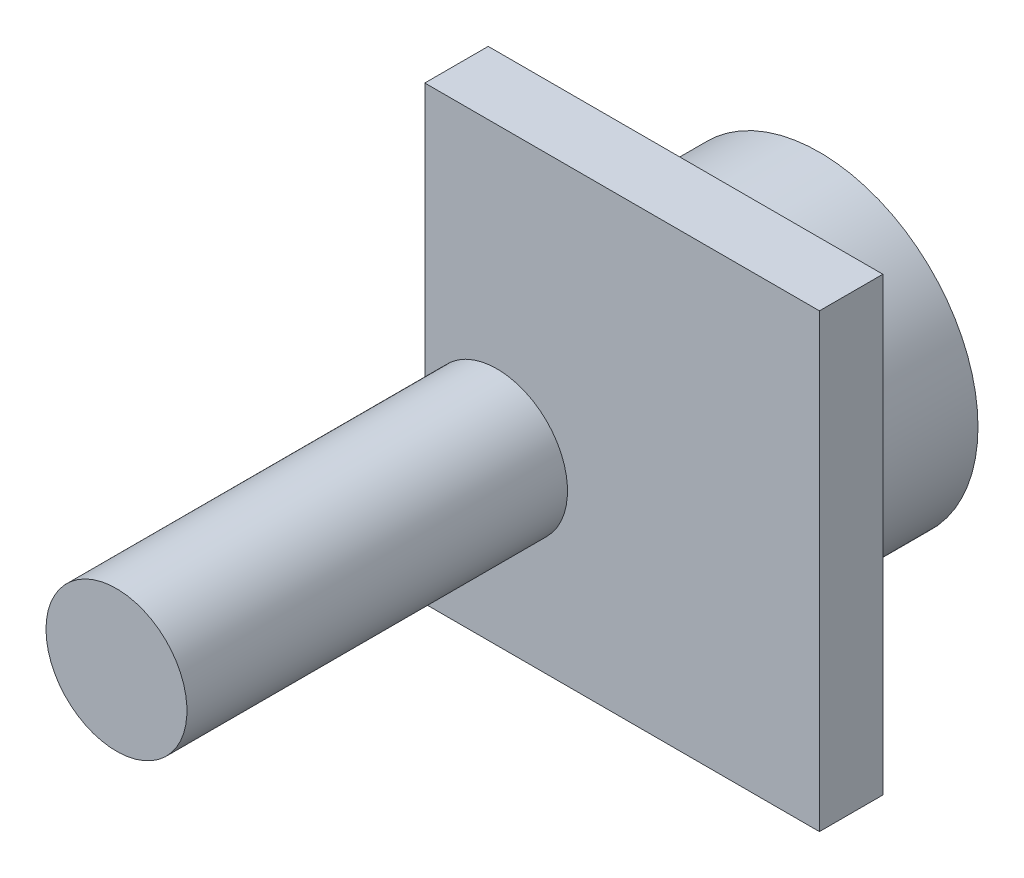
ISO-10303-21;
HEADER;
FILE_DESCRIPTION(('STEP AP214'),'2;1');
FILE_NAME('part.step','',(''),(''),'','','');
FILE_SCHEMA(('AUTOMOTIVE_DESIGN { 1 0 10303 214 1 1 1 1 }'));
ENDSEC;
DATA;
#1=APPLICATION_CONTEXT('core data for automotive mechanical design processes');
#2=APPLICATION_PROTOCOL_DEFINITION('international standard','automotive_design',2000,#1);
#3=PRODUCT_CONTEXT('',#1,'mechanical');
#4=PRODUCT('Part','Part','',(#3));
#5=PRODUCT_RELATED_PRODUCT_CATEGORY('part','',(#4));
#6=PRODUCT_DEFINITION_FORMATION('','',#4);
#7=PRODUCT_DEFINITION_CONTEXT('part definition',#1,'design');
#8=PRODUCT_DEFINITION('design','',#6,#7);
#9=PRODUCT_DEFINITION_SHAPE('','',#8);
#10=(LENGTH_UNIT() NAMED_UNIT(*) SI_UNIT(.MILLI.,.METRE.));
#11=(NAMED_UNIT(*) PLANE_ANGLE_UNIT() SI_UNIT($,.RADIAN.));
#12=(NAMED_UNIT(*) SI_UNIT($,.STERADIAN.) SOLID_ANGLE_UNIT());
#13=UNCERTAINTY_MEASURE_WITH_UNIT(LENGTH_MEASURE(1.E-05),#10,'distance_accuracy_value','');
#14=(GEOMETRIC_REPRESENTATION_CONTEXT(3) GLOBAL_UNCERTAINTY_ASSIGNED_CONTEXT((#13)) GLOBAL_UNIT_ASSIGNED_CONTEXT((#10,
#11,#12)) REPRESENTATION_CONTEXT('',''));
#15=CARTESIAN_POINT('',(0.,0.,0.));
#16=DIRECTION('',(0.,0.,1.));
#17=DIRECTION('',(1.,0.,0.));
#18=AXIS2_PLACEMENT_3D('',#15,#16,#17);
#19=CARTESIAN_POINT('',(0.,0.,0.));
#20=DIRECTION('',(0.,0.,1.));
#21=DIRECTION('',(1.,0.,0.));
#22=AXIS2_PLACEMENT_3D('',#19,#20,#21);
#23=CYLINDRICAL_SURFACE('',#22,3.);
#24=CARTESIAN_POINT('',(0.,0.,0.));
#25=DIRECTION('',(0.,0.,-1.));
#26=DIRECTION('',(-1.,0.,0.));
#27=AXIS2_PLACEMENT_3D('',#24,#25,#26);
#28=CIRCLE('',#27,3.);
#29=CARTESIAN_POINT('',(-3.,0.,0.));
#30=VERTEX_POINT('',#29);
#31=EDGE_CURVE('E11',#30,#30,#28,.T.);
#32=ORIENTED_EDGE('',*,*,#31,.F.);
#33=EDGE_LOOP('',(#32));
#34=FACE_BOUND('',#33,.T.);
#35=CARTESIAN_POINT('',(0.,0.,1.));
#36=DIRECTION('',(0.,0.,-1.));
#37=DIRECTION('',(-1.,0.,0.));
#38=AXIS2_PLACEMENT_3D('',#35,#36,#37);
#39=CIRCLE('',#38,3.);
#40=CARTESIAN_POINT('',(-3.,0.,1.));
#41=VERTEX_POINT('',#40);
#42=EDGE_CURVE('E53',#41,#41,#39,.T.);
#43=ORIENTED_EDGE('',*,*,#42,.T.);
#44=EDGE_LOOP('',(#43));
#45=FACE_BOUND('',#44,.T.);
#46=ADVANCED_FACE('F50',(#34,#45),#23,.T.);
#47=CARTESIAN_POINT('',(0.,0.,0.));
#48=DIRECTION('',(0.,0.,-1.));
#49=DIRECTION('',(-1.,0.,0.));
#50=AXIS2_PLACEMENT_3D('',#47,#48,#49);
#51=PLANE('',#50);
#52=ORIENTED_EDGE('',*,*,#31,.T.);
#53=EDGE_LOOP('',(#52));
#54=FACE_BOUND('',#53,.T.);
#55=ADVANCED_FACE('F65',(#54),#51,.T.);
#56=CARTESIAN_POINT('',(0.,0.,1.));
#57=DIRECTION('',(0.,0.,-1.));
#58=DIRECTION('',(-1.,0.,0.));
#59=AXIS2_PLACEMENT_3D('',#56,#57,#58);
#60=PLANE('',#59);
#61=ORIENTED_EDGE('',*,*,#42,.F.);
#62=EDGE_LOOP('',(#61));
#63=FACE_BOUND('',#62,.T.);
#64=ADVANCED_FACE('F63',(#63),#60,.F.);
#65=CLOSED_SHELL('',(#46,#55,#64));
#66=MANIFOLD_SOLID_BREP('B2',#65);
#67=CARTESIAN_POINT('',(0.,0.,4.));
#68=DIRECTION('',(0.,0.,-1.));
#69=DIRECTION('',(-1.,0.,0.));
#70=AXIS2_PLACEMENT_3D('',#67,#68,#69);
#71=CYLINDRICAL_SURFACE('',#70,4.5);
#72=CARTESIAN_POINT('',(0.,0.,4.));
#73=DIRECTION('',(0.,0.,1.));
#74=DIRECTION('',(1.,0.,0.));
#75=AXIS2_PLACEMENT_3D('',#72,#73,#74);
#76=CIRCLE('',#75,4.5);
#77=CARTESIAN_POINT('',(4.5,0.,4.));
#78=VERTEX_POINT('',#77);
#79=EDGE_CURVE('E104',#78,#78,#76,.T.);
#80=ORIENTED_EDGE('',*,*,#79,.F.);
#81=EDGE_LOOP('',(#80));
#82=FACE_BOUND('',#81,.T.);
#83=CARTESIAN_POINT('',(0.,0.,0.));
#84=DIRECTION('',(0.,0.,1.));
#85=DIRECTION('',(1.,0.,0.));
#86=AXIS2_PLACEMENT_3D('',#83,#84,#85);
#87=CIRCLE('',#86,4.5);
#88=CARTESIAN_POINT('',(4.5,0.,0.));
#89=VERTEX_POINT('',#88);
#90=EDGE_CURVE('E162',#89,#89,#87,.T.);
#91=ORIENTED_EDGE('',*,*,#90,.T.);
#92=EDGE_LOOP('',(#91));
#93=FACE_BOUND('',#92,.T.);
#94=ADVANCED_FACE('F96',(#82,#93),#71,.T.);
#95=CARTESIAN_POINT('',(0.,0.,0.));
#96=DIRECTION('',(0.,0.,1.));
#97=DIRECTION('',(1.,0.,0.));
#98=AXIS2_PLACEMENT_3D('',#95,#96,#97);
#99=PLANE('',#98);
#100=CARTESIAN_POINT('',(0.,0.,0.));
#101=DIRECTION('',(0.,0.,-1.));
#102=DIRECTION('',(-1.,0.,0.));
#103=AXIS2_PLACEMENT_3D('',#100,#101,#102);
#104=CIRCLE('',#103,3.);
#105=CARTESIAN_POINT('',(-3.,0.,0.));
#106=VERTEX_POINT('',#105);
#107=EDGE_CURVE('E232',#106,#106,#104,.T.);
#108=ORIENTED_EDGE('',*,*,#107,.F.);
#109=EDGE_LOOP('',(#108));
#110=FACE_BOUND('',#109,.T.);
#111=ORIENTED_EDGE('',*,*,#90,.F.);
#112=EDGE_LOOP('',(#111));
#113=FACE_BOUND('',#112,.T.);
#114=ADVANCED_FACE('F170',(#110,#113),#99,.F.);
#115=CARTESIAN_POINT('',(-5.4,7.4,5.8));
#116=DIRECTION('',(1.,0.,0.));
#117=DIRECTION('',(0.,1.,0.));
#118=AXIS2_PLACEMENT_3D('',#115,#116,#117);
#119=PLANE('',#118);
#120=DIRECTION('',(0.,-1.,0.));
#121=VECTOR('',#120,1.);
#122=CARTESIAN_POINT('',(-5.4,7.4,5.8));
#123=LINE('',#122,#121);
#124=CARTESIAN_POINT('',(-5.4,6.4,5.8));
#125=VERTEX_POINT('',#124);
#126=CARTESIAN_POINT('',(-5.4,-6.4,5.8));
#127=VERTEX_POINT('',#126);
#128=EDGE_CURVE('E154',#125,#127,#123,.T.);
#129=ORIENTED_EDGE('',*,*,#128,.F.);
#130=DIRECTION('',(0.,0.,1.));
#131=VECTOR('',#130,1.);
#132=CARTESIAN_POINT('',(-5.4,6.4,3.8));
#133=LINE('',#132,#131);
#134=CARTESIAN_POINT('',(-5.4,6.4,4.));
#135=VERTEX_POINT('',#134);
#136=EDGE_CURVE('E217',#135,#125,#133,.T.);
#137=ORIENTED_EDGE('',*,*,#136,.F.);
#138=DIRECTION('',(0.,-1.,0.));
#139=VECTOR('',#138,1.);
#140=CARTESIAN_POINT('',(-5.4,7.4,4.));
#141=LINE('',#140,#139);
#142=CARTESIAN_POINT('',(-5.4,-6.4,4.));
#143=VERTEX_POINT('',#142);
#144=EDGE_CURVE('E144',#135,#143,#141,.T.);
#145=ORIENTED_EDGE('',*,*,#144,.T.);
#146=DIRECTION('',(0.,0.,-1.));
#147=VECTOR('',#146,1.);
#148=CARTESIAN_POINT('',(-5.4,-6.4,5.8));
#149=LINE('',#148,#147);
#150=EDGE_CURVE('E138',#127,#143,#149,.T.);
#151=ORIENTED_EDGE('',*,*,#150,.F.);
#152=EDGE_LOOP('',(#129,#137,#145,#151));
#153=FACE_BOUND('',#152,.T.);
#154=ADVANCED_FACE('F172',(#153),#119,.F.);
#155=CARTESIAN_POINT('',(-5.4,-6.4,5.8));
#156=DIRECTION('',(0.,1.,0.));
#157=DIRECTION('',(0.,0.,1.));
#158=AXIS2_PLACEMENT_3D('',#155,#156,#157);
#159=PLANE('',#158);
#160=DIRECTION('',(1.,0.,0.));
#161=VECTOR('',#160,1.);
#162=CARTESIAN_POINT('',(-5.4,-6.4,4.));
#163=LINE('',#162,#161);
#164=CARTESIAN_POINT('',(5.8,-6.4,4.));
#165=VERTEX_POINT('',#164);
#166=EDGE_CURVE('E132',#143,#165,#163,.T.);
#167=ORIENTED_EDGE('',*,*,#166,.T.);
#168=DIRECTION('',(0.,0.,-1.));
#169=VECTOR('',#168,1.);
#170=CARTESIAN_POINT('',(5.8,-6.4,5.8));
#171=LINE('',#170,#169);
#172=CARTESIAN_POINT('',(5.8,-6.4,5.8));
#173=VERTEX_POINT('',#172);
#174=EDGE_CURVE('E135',#173,#165,#171,.T.);
#175=ORIENTED_EDGE('',*,*,#174,.F.);
#176=DIRECTION('',(1.,0.,0.));
#177=VECTOR('',#176,1.);
#178=CARTESIAN_POINT('',(-5.4,-6.4,5.8));
#179=LINE('',#178,#177);
#180=EDGE_CURVE('E119',#127,#173,#179,.T.);
#181=ORIENTED_EDGE('',*,*,#180,.F.);
#182=ORIENTED_EDGE('',*,*,#150,.T.);
#183=EDGE_LOOP('',(#167,#175,#181,#182));
#184=FACE_BOUND('',#183,.T.);
#185=ADVANCED_FACE('F134',(#184),#159,.F.);
#186=CARTESIAN_POINT('',(5.8,7.4,5.8));
#187=DIRECTION('',(-1.,0.,0.));
#188=DIRECTION('',(0.,-1.,0.));
#189=AXIS2_PLACEMENT_3D('',#186,#187,#188);
#190=PLANE('',#189);
#191=DIRECTION('',(0.,1.,0.));
#192=VECTOR('',#191,1.);
#193=CARTESIAN_POINT('',(5.8,7.4,4.));
#194=LINE('',#193,#192);
#195=CARTESIAN_POINT('',(5.8,6.4,4.));
#196=VERTEX_POINT('',#195);
#197=EDGE_CURVE('E143',#165,#196,#194,.T.);
#198=ORIENTED_EDGE('',*,*,#197,.T.);
#199=DIRECTION('',(0.,0.,1.));
#200=VECTOR('',#199,1.);
#201=CARTESIAN_POINT('',(5.8,6.4,3.8));
#202=LINE('',#201,#200);
#203=CARTESIAN_POINT('',(5.8,6.4,5.8));
#204=VERTEX_POINT('',#203);
#205=EDGE_CURVE('E111',#196,#204,#202,.T.);
#206=ORIENTED_EDGE('',*,*,#205,.T.);
#207=DIRECTION('',(0.,1.,0.));
#208=VECTOR('',#207,1.);
#209=CARTESIAN_POINT('',(5.8,7.4,5.8));
#210=LINE('',#209,#208);
#211=EDGE_CURVE('E149',#173,#204,#210,.T.);
#212=ORIENTED_EDGE('',*,*,#211,.F.);
#213=ORIENTED_EDGE('',*,*,#174,.T.);
#214=EDGE_LOOP('',(#198,#206,#212,#213));
#215=FACE_BOUND('',#214,.T.);
#216=ADVANCED_FACE('F148',(#215),#190,.F.);
#217=CARTESIAN_POINT('',(0.,0.,5.8));
#218=DIRECTION('',(0.,0.,1.));
#219=DIRECTION('',(1.,0.,0.));
#220=AXIS2_PLACEMENT_3D('',#217,#218,#219);
#221=PLANE('',#220);
#222=DIRECTION('',(1.,0.,0.));
#223=VECTOR('',#222,1.);
#224=CARTESIAN_POINT('',(-5.4,6.4,5.8));
#225=LINE('',#224,#223);
#226=EDGE_CURVE('E220',#125,#204,#225,.T.);
#227=ORIENTED_EDGE('',*,*,#226,.F.);
#228=ORIENTED_EDGE('',*,*,#128,.T.);
#229=ORIENTED_EDGE('',*,*,#180,.T.);
#230=ORIENTED_EDGE('',*,*,#211,.T.);
#231=EDGE_LOOP('',(#227,#228,#229,#230));
#232=FACE_BOUND('',#231,.T.);
#233=CARTESIAN_POINT('',(-3.35,-1.6,5.8));
#234=DIRECTION('',(0.,0.,1.));
#235=DIRECTION('',(1.,0.,0.));
#236=AXIS2_PLACEMENT_3D('',#233,#234,#235);
#237=CIRCLE('',#236,2.);
#238=CARTESIAN_POINT('',(-5.35,-1.6,5.8));
#239=VERTEX_POINT('',#238);
#240=EDGE_CURVE('E243',#239,#239,#237,.T.);
#241=ORIENTED_EDGE('',*,*,#240,.F.);
#242=EDGE_LOOP('',(#241));
#243=FACE_BOUND('',#242,.T.);
#244=ADVANCED_FACE('F188',(#232,#243),#221,.T.);
#245=CARTESIAN_POINT('',(0.,0.,4.));
#246=DIRECTION('',(0.,0.,1.));
#247=DIRECTION('',(1.,0.,0.));
#248=AXIS2_PLACEMENT_3D('',#245,#246,#247);
#249=PLANE('',#248);
#250=ORIENTED_EDGE('',*,*,#79,.T.);
#251=EDGE_LOOP('',(#250));
#252=FACE_BOUND('',#251,.T.);
#253=ORIENTED_EDGE('',*,*,#144,.F.);
#254=DIRECTION('',(1.,0.,0.));
#255=VECTOR('',#254,1.);
#256=CARTESIAN_POINT('',(0.,6.4,4.));
#257=LINE('',#256,#255);
#258=EDGE_CURVE('E48',#135,#196,#257,.T.);
#259=ORIENTED_EDGE('',*,*,#258,.T.);
#260=ORIENTED_EDGE('',*,*,#197,.F.);
#261=ORIENTED_EDGE('',*,*,#166,.F.);
#262=EDGE_LOOP('',(#253,#259,#260,#261));
#263=FACE_BOUND('',#262,.T.);
#264=ADVANCED_FACE('F152',(#252,#263),#249,.F.);
#265=CARTESIAN_POINT('',(0.,0.,1.));
#266=DIRECTION('',(0.,0.,-1.));
#267=DIRECTION('',(-1.,0.,0.));
#268=AXIS2_PLACEMENT_3D('',#265,#266,#267);
#269=CYLINDRICAL_SURFACE('',#268,3.);
#270=CARTESIAN_POINT('',(0.,0.,1.));
#271=DIRECTION('',(0.,0.,-1.));
#272=DIRECTION('',(-1.,0.,0.));
#273=AXIS2_PLACEMENT_3D('',#270,#271,#272);
#274=CIRCLE('',#273,3.);
#275=CARTESIAN_POINT('',(-3.,0.,1.));
#276=VERTEX_POINT('',#275);
#277=EDGE_CURVE('E229',#276,#276,#274,.T.);
#278=ORIENTED_EDGE('',*,*,#277,.F.);
#279=EDGE_LOOP('',(#278));
#280=FACE_BOUND('',#279,.T.);
#281=ORIENTED_EDGE('',*,*,#107,.T.);
#282=EDGE_LOOP('',(#281));
#283=FACE_BOUND('',#282,.T.);
#284=ADVANCED_FACE('F191',(#280,#283),#269,.F.);
#285=CARTESIAN_POINT('',(0.,0.,1.));
#286=DIRECTION('',(0.,0.,-1.));
#287=DIRECTION('',(-1.,0.,0.));
#288=AXIS2_PLACEMENT_3D('',#285,#286,#287);
#289=PLANE('',#288);
#290=ORIENTED_EDGE('',*,*,#277,.T.);
#291=EDGE_LOOP('',(#290));
#292=FACE_BOUND('',#291,.T.);
#293=ADVANCED_FACE('F197',(#292),#289,.T.);
#294=CARTESIAN_POINT('',(-3.35,-1.6,16.6));
#295=DIRECTION('',(0.,0.,-1.));
#296=DIRECTION('',(-1.,0.,0.));
#297=AXIS2_PLACEMENT_3D('',#294,#295,#296);
#298=CYLINDRICAL_SURFACE('',#297,2.);
#299=CARTESIAN_POINT('',(-3.35,-1.6,16.6));
#300=DIRECTION('',(0.,0.,1.));
#301=DIRECTION('',(1.,0.,0.));
#302=AXIS2_PLACEMENT_3D('',#299,#300,#301);
#303=CIRCLE('',#302,2.);
#304=CARTESIAN_POINT('',(-5.35,-1.6,16.6));
#305=VERTEX_POINT('',#304);
#306=EDGE_CURVE('E241',#305,#305,#303,.T.);
#307=CARTESIAN_POINT('',(-5.35,-1.6,16.6));
#308=CARTESIAN_POINT('',(-5.35,-1.6,16.4875));
#309=CARTESIAN_POINT('',(-5.35,-1.6,16.375));
#310=CARTESIAN_POINT('',(-5.35,-1.6,16.15));
#311=CARTESIAN_POINT('',(-5.35,-1.6,16.0375));
#312=CARTESIAN_POINT('',(-5.35,-1.6,15.8125));
#313=CARTESIAN_POINT('',(-5.35,-1.6,15.7));
#314=CARTESIAN_POINT('',(-5.35,-1.6,15.475));
#315=CARTESIAN_POINT('',(-5.35,-1.6,15.3625));
#316=CARTESIAN_POINT('',(-5.35,-1.6,15.1375));
#317=CARTESIAN_POINT('',(-5.35,-1.6,15.025));
#318=CARTESIAN_POINT('',(-5.35,-1.6,14.8));
#319=CARTESIAN_POINT('',(-5.35,-1.6,14.6875));
#320=CARTESIAN_POINT('',(-5.35,-1.6,14.4625));
#321=CARTESIAN_POINT('',(-5.35,-1.6,14.35));
#322=CARTESIAN_POINT('',(-5.35,-1.6,14.125));
#323=CARTESIAN_POINT('',(-5.35,-1.6,14.0125));
#324=CARTESIAN_POINT('',(-5.35,-1.6,13.7875));
#325=CARTESIAN_POINT('',(-5.35,-1.6,13.675));
#326=CARTESIAN_POINT('',(-5.35,-1.6,13.45));
#327=CARTESIAN_POINT('',(-5.35,-1.6,13.3375));
#328=CARTESIAN_POINT('',(-5.35,-1.6,13.1125));
#329=CARTESIAN_POINT('',(-5.35,-1.6,13.));
#330=CARTESIAN_POINT('',(-5.35,-1.6,12.775));
#331=CARTESIAN_POINT('',(-5.35,-1.6,12.6625));
#332=CARTESIAN_POINT('',(-5.35,-1.6,12.4375));
#333=CARTESIAN_POINT('',(-5.35,-1.6,12.325));
#334=CARTESIAN_POINT('',(-5.35,-1.6,12.1));
#335=CARTESIAN_POINT('',(-5.35,-1.6,11.9875));
#336=CARTESIAN_POINT('',(-5.35,-1.6,11.7625));
#337=CARTESIAN_POINT('',(-5.35,-1.6,11.65));
#338=CARTESIAN_POINT('',(-5.35,-1.6,11.425));
#339=CARTESIAN_POINT('',(-5.35,-1.6,11.3125));
#340=CARTESIAN_POINT('',(-5.35,-1.6,11.0875));
#341=CARTESIAN_POINT('',(-5.35,-1.6,10.975));
#342=CARTESIAN_POINT('',(-5.35,-1.6,10.75));
#343=CARTESIAN_POINT('',(-5.35,-1.6,10.6375));
#344=CARTESIAN_POINT('',(-5.35,-1.6,10.4125));
#345=CARTESIAN_POINT('',(-5.35,-1.6,10.3));
#346=CARTESIAN_POINT('',(-5.35,-1.6,10.075));
#347=CARTESIAN_POINT('',(-5.35,-1.6,9.9625));
#348=CARTESIAN_POINT('',(-5.35,-1.6,9.7375));
#349=CARTESIAN_POINT('',(-5.35,-1.6,9.625));
#350=CARTESIAN_POINT('',(-5.35,-1.6,9.4));
#351=CARTESIAN_POINT('',(-5.35,-1.6,9.2875));
#352=CARTESIAN_POINT('',(-5.35,-1.6,9.0625));
#353=CARTESIAN_POINT('',(-5.35,-1.6,8.95));
#354=CARTESIAN_POINT('',(-5.35,-1.6,8.725));
#355=CARTESIAN_POINT('',(-5.35,-1.6,8.6125));
#356=CARTESIAN_POINT('',(-5.35,-1.6,8.3875));
#357=CARTESIAN_POINT('',(-5.35,-1.6,8.275));
#358=CARTESIAN_POINT('',(-5.35,-1.6,8.05));
#359=CARTESIAN_POINT('',(-5.35,-1.6,7.9375));
#360=CARTESIAN_POINT('',(-5.35,-1.6,7.7125));
#361=CARTESIAN_POINT('',(-5.35,-1.6,7.6));
#362=CARTESIAN_POINT('',(-5.35,-1.6,7.375));
#363=CARTESIAN_POINT('',(-5.35,-1.6,7.2625));
#364=CARTESIAN_POINT('',(-5.35,-1.6,7.0375));
#365=CARTESIAN_POINT('',(-5.35,-1.6,6.925));
#366=CARTESIAN_POINT('',(-5.35,-1.6,6.7));
#367=CARTESIAN_POINT('',(-5.35,-1.6,6.5875));
#368=CARTESIAN_POINT('',(-5.35,-1.6,6.3625));
#369=CARTESIAN_POINT('',(-5.35,-1.6,6.25));
#370=CARTESIAN_POINT('',(-5.35,-1.6,6.025));
#371=CARTESIAN_POINT('',(-5.35,-1.6,5.9125));
#372=CARTESIAN_POINT('',(-5.35,-1.6,5.8));
#373=B_SPLINE_CURVE_WITH_KNOTS('',3,(#307,#308,#309,#310,#311,#312,#313,#314,#315,#316,#317,
#318,#319,#320,#321,#322,#323,#324,#325,#326,#327,#328,#329,#330,#331,#332,#333,#334,#335,#336,
#337,#338,#339,#340,#341,#342,#343,#344,#345,#346,#347,#348,#349,#350,#351,#352,#353,#354,#355,
#356,#357,#358,#359,#360,#361,#362,#363,#364,#365,#366,#367,#368,#369,#370,#371,#372),
.UNSPECIFIED.,.F.,.F.,(4,2,2,2,2,2,2,2,2,2,2,2,2,2,2,2,2,2,2,2,2,2,2,2,2,2,2,2,2,2,2,2,4),(0.,
0.337500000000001,0.675000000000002,1.0125,1.35,1.6875,2.025,2.3625,2.7,3.0375,3.375,3.7125,
4.05,4.3875,4.725,5.0625,5.4,5.7375,6.075,6.4125,6.75,7.0875,7.425,7.7625,8.1,8.4375,8.775,
9.1125,9.45,9.7875,10.125,10.4625,10.8),.UNSPECIFIED.);
#374=EDGE_CURVE('BSEAM201',#305,#239,#373,.T.);
#375=ORIENTED_EDGE('',*,*,#306,.F.);
#376=ORIENTED_EDGE('',*,*,#240,.T.);
#377=ORIENTED_EDGE('',*,*,#374,.T.);
#378=ORIENTED_EDGE('',*,*,#374,.F.);
#379=EDGE_LOOP('',(#375,#377,#376,#378));
#380=FACE_BOUND('',#379,.T.);
#381=ADVANCED_FACE('F201',(#380),#298,.T.);
#382=CARTESIAN_POINT('',(-3.35,-1.6,16.6));
#383=DIRECTION('',(0.,0.,1.));
#384=DIRECTION('',(1.,0.,0.));
#385=AXIS2_PLACEMENT_3D('',#382,#383,#384);
#386=PLANE('',#385);
#387=ORIENTED_EDGE('',*,*,#306,.T.);
#388=EDGE_LOOP('',(#387));
#389=FACE_BOUND('',#388,.T.);
#390=ADVANCED_FACE('F205',(#389),#386,.T.);
#391=CARTESIAN_POINT('',(-5.4,6.4,3.8));
#392=DIRECTION('',(0.,-1.,0.));
#393=DIRECTION('',(0.,0.,-1.));
#394=AXIS2_PLACEMENT_3D('',#391,#392,#393);
#395=PLANE('',#394);
#396=ORIENTED_EDGE('',*,*,#136,.T.);
#397=ORIENTED_EDGE('',*,*,#226,.T.);
#398=ORIENTED_EDGE('',*,*,#205,.F.);
#399=ORIENTED_EDGE('',*,*,#258,.F.);
#400=EDGE_LOOP('',(#396,#397,#398,#399));
#401=FACE_BOUND('',#400,.T.);
#402=ADVANCED_FACE('F209',(#401),#395,.F.);
#403=CLOSED_SHELL('',(#94,#114,#154,#185,#216,#244,#264,#284,#293,#381,#390,#402));
#404=MANIFOLD_SOLID_BREP('B6',#403);
#405=ADVANCED_BREP_SHAPE_REPRESENTATION('',(#18,#66,#404),#14);
#406=SHAPE_DEFINITION_REPRESENTATION(#9,#405);
ENDSEC;
END-ISO-10303-21;
